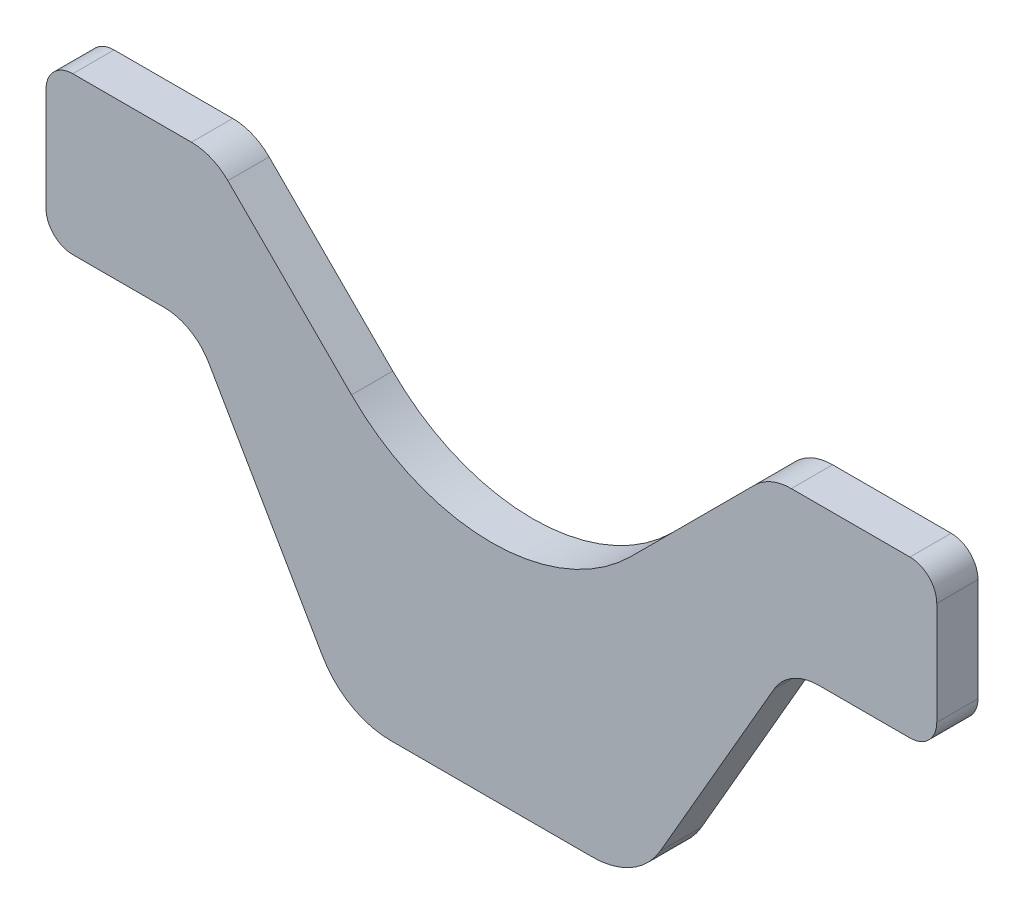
from build123d import *

# Parameters (mm, degrees)
BOSS_EXTRU_1_DEPTH = 10


with BuildPart() as part:
    # Esquisse1 → Boss.-Extru.1 (new body)
    with BuildSketch(Plane.XY):
        with BuildLine():
            Line((24.5, 0), (-24.5, 0))
            ThreePointArc((-24.5, 0), (-34, 2.545517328), (-40.954482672, 9.5))
            Line((-40.954482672, 9.5), (-68.522958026, 57.25))
            ThreePointArc((-68.522958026, 57.25), (-73.098275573, 61.825317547), (-79.348275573, 63.5))
            Line((-79.348275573, 63.5), (-101.5, 63.5))
            ThreePointArc((-101.5, 63.5), (-106.096194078, 65.403805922), (-108, 70))
            Line((-108, 70), (-108, 95))
            ThreePointArc((-108, 95), (-106.096194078, 99.596194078), (-101.5, 101.5))
            Line((-101.5, 101.5), (-72.737439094, 101.5))
            ThreePointArc((-72.737439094, 101.5), (-67.95389619, 100.548494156), (-63.898604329, 97.838834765))
            Line((-63.898604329, 97.838834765), (-33.914055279, 67.854285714))
            ThreePointArc((-33.914055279, 67.854285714), (0, 53.806624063), (33.914055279, 67.854285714))
            Line((33.914055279, 67.854285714), (63.898604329, 97.838834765))
            ThreePointArc((63.898604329, 97.838834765), (67.95389619, 100.548494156), (72.737439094, 101.5))
            Line((72.737439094, 101.5), (101.5, 101.5))
            ThreePointArc((101.5, 101.5), (106.096194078, 99.596194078), (108, 95))
            Line((108, 95), (108, 70))
            ThreePointArc((108, 70), (106.096194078, 65.403805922), (101.5, 63.5))
            Line((101.5, 63.5), (79.348275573, 63.5))
            ThreePointArc((79.348275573, 63.5), (73.098275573, 61.825317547), (68.522958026, 57.25))
            Line((68.522958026, 57.25), (40.954482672, 9.5))
            ThreePointArc((40.954482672, 9.5), (34, 2.545517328), (24.5, 0))
        make_face()
    extrude(amount=BOSS_EXTRU_1_DEPTH)


solid = part.part
